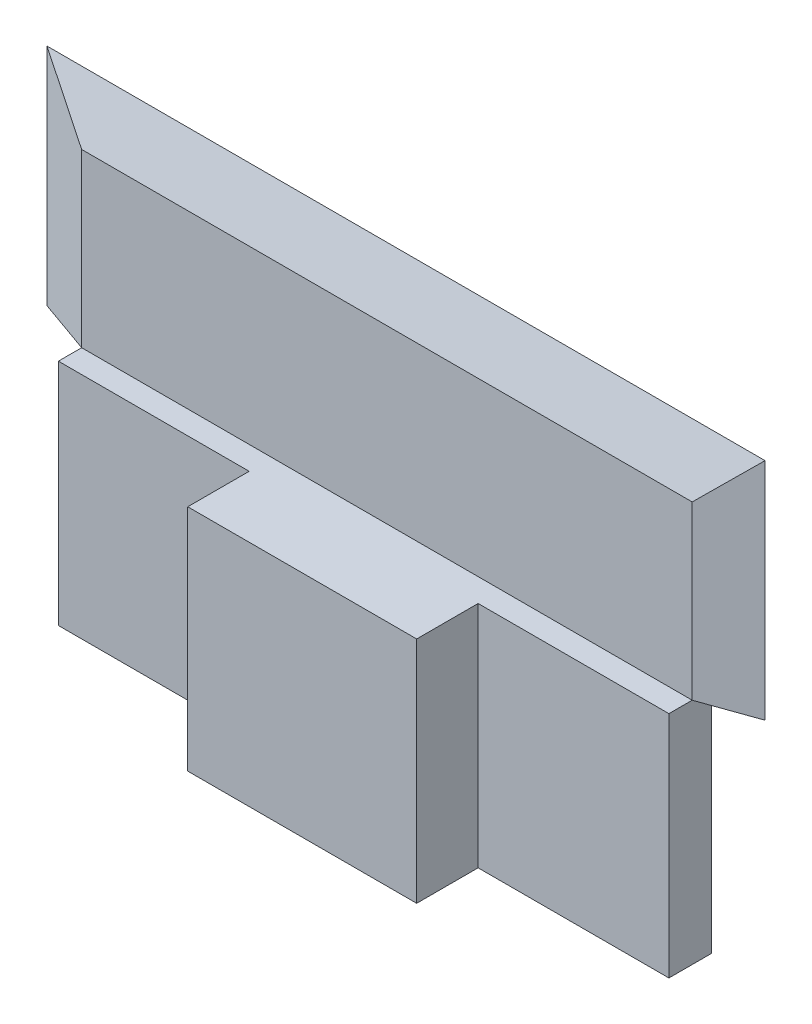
ISO-10303-21;
HEADER;
FILE_DESCRIPTION(('STEP AP214'),'2;1');
FILE_NAME('part.step','',(''),(''),'','','');
FILE_SCHEMA(('AUTOMOTIVE_DESIGN { 1 0 10303 214 1 1 1 1 }'));
ENDSEC;
DATA;
#1=APPLICATION_CONTEXT('core data for automotive mechanical design processes');
#2=APPLICATION_PROTOCOL_DEFINITION('international standard','automotive_design',2000,#1);
#3=PRODUCT_CONTEXT('',#1,'mechanical');
#4=PRODUCT('Part','Part','',(#3));
#5=PRODUCT_RELATED_PRODUCT_CATEGORY('part','',(#4));
#6=PRODUCT_DEFINITION_FORMATION('','',#4);
#7=PRODUCT_DEFINITION_CONTEXT('part definition',#1,'design');
#8=PRODUCT_DEFINITION('design','',#6,#7);
#9=PRODUCT_DEFINITION_SHAPE('','',#8);
#10=(LENGTH_UNIT() NAMED_UNIT(*) SI_UNIT(.MILLI.,.METRE.));
#11=(NAMED_UNIT(*) PLANE_ANGLE_UNIT() SI_UNIT($,.RADIAN.));
#12=(NAMED_UNIT(*) SI_UNIT($,.STERADIAN.) SOLID_ANGLE_UNIT());
#13=UNCERTAINTY_MEASURE_WITH_UNIT(LENGTH_MEASURE(1.E-05),#10,'distance_accuracy_value','');
#14=(GEOMETRIC_REPRESENTATION_CONTEXT(3) GLOBAL_UNCERTAINTY_ASSIGNED_CONTEXT((#13)) GLOBAL_UNIT_ASSIGNED_CONTEXT((#10,
#11,#12)) REPRESENTATION_CONTEXT('',''));
#15=CARTESIAN_POINT('',(0.,0.,0.));
#16=DIRECTION('',(0.,0.,1.));
#17=DIRECTION('',(1.,0.,0.));
#18=AXIS2_PLACEMENT_3D('',#15,#16,#17);
#19=CARTESIAN_POINT('',(0.,60.96,11.2776));
#20=DIRECTION('',(0.,-1.,0.));
#21=DIRECTION('',(0.,0.,-1.));
#22=AXIS2_PLACEMENT_3D('',#19,#20,#21);
#23=PLANE('',#22);
#24=DIRECTION('',(1.,0.,0.));
#25=VECTOR('',#24,1.);
#26=CARTESIAN_POINT('',(0.,60.96,5.08));
#27=LINE('',#26,#25);
#28=CARTESIAN_POINT('',(-81.28,60.96,5.08));
#29=VERTEX_POINT('',#28);
#30=CARTESIAN_POINT('',(81.28,60.96,5.08));
#31=VERTEX_POINT('',#30);
#32=EDGE_CURVE('E148',#29,#31,#27,.T.);
#33=ORIENTED_EDGE('',*,*,#32,.F.);
#34=DIRECTION('',(0.,0.,-1.));
#35=VECTOR('',#34,1.);
#36=CARTESIAN_POINT('',(-81.28,60.96,11.2776));
#37=LINE('',#36,#35);
#38=CARTESIAN_POINT('',(-81.28,60.96,11.2776));
#39=VERTEX_POINT('',#38);
#40=EDGE_CURVE('E152',#39,#29,#37,.T.);
#41=ORIENTED_EDGE('',*,*,#40,.F.);
#42=DIRECTION('',(1.,0.,0.));
#43=VECTOR('',#42,1.);
#44=CARTESIAN_POINT('',(0.,60.96,11.2776));
#45=LINE('',#44,#43);
#46=CARTESIAN_POINT('',(-30.48,60.96,11.2776));
#47=VERTEX_POINT('',#46);
#48=EDGE_CURVE('E337',#39,#47,#45,.T.);
#49=ORIENTED_EDGE('',*,*,#48,.T.);
#50=DIRECTION('',(0.,0.,-1.));
#51=VECTOR('',#50,1.);
#52=CARTESIAN_POINT('',(-30.48,60.96,27.6352));
#53=LINE('',#52,#51);
#54=CARTESIAN_POINT('',(-30.48,60.96,27.6352));
#55=VERTEX_POINT('',#54);
#56=EDGE_CURVE('E338',#55,#47,#53,.T.);
#57=ORIENTED_EDGE('',*,*,#56,.F.);
#58=DIRECTION('',(-1.,0.,0.));
#59=VECTOR('',#58,1.);
#60=CARTESIAN_POINT('',(0.,60.96,27.6352));
#61=LINE('',#60,#59);
#62=CARTESIAN_POINT('',(30.48,60.96,27.6352));
#63=VERTEX_POINT('',#62);
#64=EDGE_CURVE('E359',#63,#55,#61,.T.);
#65=ORIENTED_EDGE('',*,*,#64,.F.);
#66=DIRECTION('',(0.,0.,-1.));
#67=VECTOR('',#66,1.);
#68=CARTESIAN_POINT('',(30.48,60.96,27.6352));
#69=LINE('',#68,#67);
#70=CARTESIAN_POINT('',(30.48,60.96,11.2776));
#71=VERTEX_POINT('',#70);
#72=EDGE_CURVE('E514',#63,#71,#69,.T.);
#73=ORIENTED_EDGE('',*,*,#72,.T.);
#74=DIRECTION('',(-1.,0.,0.));
#75=VECTOR('',#74,1.);
#76=CARTESIAN_POINT('',(0.,60.96,11.2776));
#77=LINE('',#76,#75);
#78=CARTESIAN_POINT('',(81.28,60.96,11.2776));
#79=VERTEX_POINT('',#78);
#80=EDGE_CURVE('E518',#79,#71,#77,.T.);
#81=ORIENTED_EDGE('',*,*,#80,.F.);
#82=DIRECTION('',(0.,0.,-1.));
#83=VECTOR('',#82,1.);
#84=CARTESIAN_POINT('',(81.28,60.96,11.2776));
#85=LINE('',#84,#83);
#86=EDGE_CURVE('E60',#79,#31,#85,.T.);
#87=ORIENTED_EDGE('',*,*,#86,.T.);
#88=EDGE_LOOP('',(#33,#41,#49,#57,#65,#73,#81,#87));
#89=FACE_BOUND('',#88,.T.);
#90=ADVANCED_FACE('F49',(#89),#23,.F.);
#91=CARTESIAN_POINT('',(0.,0.,11.2776));
#92=DIRECTION('',(0.,0.,-1.));
#93=DIRECTION('',(-1.,0.,0.));
#94=AXIS2_PLACEMENT_3D('',#91,#92,#93);
#95=PLANE('',#94);
#96=DIRECTION('',(0.,1.,0.));
#97=VECTOR('',#96,1.);
#98=CARTESIAN_POINT('',(30.48,60.96,11.2776));
#99=LINE('',#98,#97);
#100=CARTESIAN_POINT('',(30.48,0.,11.2776));
#101=VERTEX_POINT('',#100);
#102=EDGE_CURVE('E76',#101,#71,#99,.T.);
#103=ORIENTED_EDGE('',*,*,#102,.F.);
#104=DIRECTION('',(1.,0.,0.));
#105=VECTOR('',#104,1.);
#106=CARTESIAN_POINT('',(0.,0.,11.2776));
#107=LINE('',#106,#105);
#108=CARTESIAN_POINT('',(81.28,0.,11.2776));
#109=VERTEX_POINT('',#108);
#110=EDGE_CURVE('E424',#101,#109,#107,.T.);
#111=ORIENTED_EDGE('',*,*,#110,.T.);
#112=DIRECTION('',(0.,1.,0.));
#113=VECTOR('',#112,1.);
#114=CARTESIAN_POINT('',(81.28,0.,11.2776));
#115=LINE('',#114,#113);
#116=EDGE_CURVE('E426',#109,#79,#115,.T.);
#117=ORIENTED_EDGE('',*,*,#116,.T.);
#118=ORIENTED_EDGE('',*,*,#80,.T.);
#119=EDGE_LOOP('',(#103,#111,#117,#118));
#120=FACE_BOUND('',#119,.T.);
#121=ADVANCED_FACE('F401',(#120),#95,.F.);
#122=CARTESIAN_POINT('',(0.,0.,11.2776));
#123=DIRECTION('',(0.,1.,0.));
#124=DIRECTION('',(0.,0.,1.));
#125=AXIS2_PLACEMENT_3D('',#122,#123,#124);
#126=PLANE('',#125);
#127=DIRECTION('',(1.,0.,0.));
#128=VECTOR('',#127,1.);
#129=CARTESIAN_POINT('',(0.,0.,0.));
#130=LINE('',#129,#128);
#131=CARTESIAN_POINT('',(-81.28,0.,0.));
#132=VERTEX_POINT('',#131);
#133=CARTESIAN_POINT('',(81.28,0.,0.));
#134=VERTEX_POINT('',#133);
#135=EDGE_CURVE('E354',#132,#134,#130,.T.);
#136=ORIENTED_EDGE('',*,*,#135,.T.);
#137=DIRECTION('',(0.,0.,-1.));
#138=VECTOR('',#137,1.);
#139=CARTESIAN_POINT('',(81.28,0.,11.2776));
#140=LINE('',#139,#138);
#141=EDGE_CURVE('E12',#109,#134,#140,.T.);
#142=ORIENTED_EDGE('',*,*,#141,.F.);
#143=ORIENTED_EDGE('',*,*,#110,.F.);
#144=DIRECTION('',(0.,0.,-1.));
#145=VECTOR('',#144,1.);
#146=CARTESIAN_POINT('',(30.48,0.,27.6352));
#147=LINE('',#146,#145);
#148=CARTESIAN_POINT('',(30.48,0.,27.6352));
#149=VERTEX_POINT('',#148);
#150=EDGE_CURVE('E428',#149,#101,#147,.T.);
#151=ORIENTED_EDGE('',*,*,#150,.F.);
#152=DIRECTION('',(1.,0.,0.));
#153=VECTOR('',#152,1.);
#154=CARTESIAN_POINT('',(0.,0.,27.6352));
#155=LINE('',#154,#153);
#156=CARTESIAN_POINT('',(-30.48,0.,27.6352));
#157=VERTEX_POINT('',#156);
#158=EDGE_CURVE('E316',#157,#149,#155,.T.);
#159=ORIENTED_EDGE('',*,*,#158,.F.);
#160=DIRECTION('',(0.,0.,-1.));
#161=VECTOR('',#160,1.);
#162=CARTESIAN_POINT('',(-30.48,0.,27.6352));
#163=LINE('',#162,#161);
#164=CARTESIAN_POINT('',(-30.48,0.,11.2776));
#165=VERTEX_POINT('',#164);
#166=EDGE_CURVE('E341',#157,#165,#163,.T.);
#167=ORIENTED_EDGE('',*,*,#166,.T.);
#168=DIRECTION('',(-1.,0.,0.));
#169=VECTOR('',#168,1.);
#170=CARTESIAN_POINT('',(0.,0.,11.2776));
#171=LINE('',#170,#169);
#172=CARTESIAN_POINT('',(-81.28,0.,11.2776));
#173=VERTEX_POINT('',#172);
#174=EDGE_CURVE('E349',#165,#173,#171,.T.);
#175=ORIENTED_EDGE('',*,*,#174,.T.);
#176=DIRECTION('',(0.,0.,-1.));
#177=VECTOR('',#176,1.);
#178=CARTESIAN_POINT('',(-81.28,0.,11.2776));
#179=LINE('',#178,#177);
#180=EDGE_CURVE('E175',#173,#132,#179,.T.);
#181=ORIENTED_EDGE('',*,*,#180,.T.);
#182=EDGE_LOOP('',(#136,#142,#143,#151,#159,#167,#175,#181));
#183=FACE_BOUND('',#182,.T.);
#184=ADVANCED_FACE('F51',(#183),#126,.F.);
#185=CARTESIAN_POINT('',(81.28,0.,11.2776));
#186=DIRECTION('',(-1.,0.,0.));
#187=DIRECTION('',(0.,0.,1.));
#188=AXIS2_PLACEMENT_3D('',#185,#186,#187);
#189=PLANE('',#188);
#190=DIRECTION('',(0.,1.,0.));
#191=VECTOR('',#190,1.);
#192=CARTESIAN_POINT('',(81.28,0.,0.));
#193=LINE('',#192,#191);
#194=CARTESIAN_POINT('',(81.28,60.96,0.));
#195=VERTEX_POINT('',#194);
#196=EDGE_CURVE('E420',#134,#195,#193,.T.);
#197=ORIENTED_EDGE('',*,*,#196,.T.);
#198=EDGE_CURVE('E421',#31,#195,#85,.T.);
#199=ORIENTED_EDGE('',*,*,#198,.F.);
#200=ORIENTED_EDGE('',*,*,#86,.F.);
#201=ORIENTED_EDGE('',*,*,#116,.F.);
#202=ORIENTED_EDGE('',*,*,#141,.T.);
#203=EDGE_LOOP('',(#197,#199,#200,#201,#202));
#204=FACE_BOUND('',#203,.T.);
#205=ADVANCED_FACE('F409',(#204),#189,.F.);
#206=CARTESIAN_POINT('',(0.,0.,0.));
#207=DIRECTION('',(0.,0.,-1.));
#208=DIRECTION('',(-1.,0.,0.));
#209=AXIS2_PLACEMENT_3D('',#206,#207,#208);
#210=PLANE('',#209);
#211=ORIENTED_EDGE('',*,*,#135,.F.);
#212=DIRECTION('',(0.,1.,0.));
#213=VECTOR('',#212,1.);
#214=CARTESIAN_POINT('',(-81.28,0.,0.));
#215=LINE('',#214,#213);
#216=CARTESIAN_POINT('',(-81.2800125,60.96,0.));
#217=VERTEX_POINT('',#216);
#218=EDGE_CURVE('E336',#132,#217,#215,.T.);
#219=ORIENTED_EDGE('',*,*,#218,.T.);
#220=DIRECTION('',(1.,0.,0.));
#221=VECTOR('',#220,1.);
#222=CARTESIAN_POINT('',(0.,60.96,0.));
#223=LINE('',#222,#221);
#224=CARTESIAN_POINT('',(-95.6056,60.96,0.));
#225=VERTEX_POINT('',#224);
#226=EDGE_CURVE('E170',#225,#217,#223,.T.);
#227=ORIENTED_EDGE('',*,*,#226,.F.);
#228=DIRECTION('',(0.,-1.,0.));
#229=VECTOR('',#228,1.);
#230=CARTESIAN_POINT('',(-95.6056,60.96,0.));
#231=LINE('',#230,#229);
#232=CARTESIAN_POINT('',(-95.6056,120.8278,0.));
#233=VERTEX_POINT('',#232);
#234=EDGE_CURVE('E184',#233,#225,#231,.T.);
#235=ORIENTED_EDGE('',*,*,#234,.F.);
#236=DIRECTION('',(-1.,0.,0.));
#237=VECTOR('',#236,1.);
#238=CARTESIAN_POINT('',(0.,120.8278,0.));
#239=LINE('',#238,#237);
#240=CARTESIAN_POINT('',(0.,120.8278,0.));
#241=VERTEX_POINT('',#240);
#242=EDGE_CURVE('E265',#241,#233,#239,.T.);
#243=ORIENTED_EDGE('',*,*,#242,.F.);
#244=DIRECTION('',(1.,0.,0.));
#245=VECTOR('',#244,1.);
#246=CARTESIAN_POINT('',(0.,120.8278,0.));
#247=LINE('',#246,#245);
#248=CARTESIAN_POINT('',(95.6056,120.8278,0.));
#249=VERTEX_POINT('',#248);
#250=EDGE_CURVE('E313',#241,#249,#247,.T.);
#251=ORIENTED_EDGE('',*,*,#250,.T.);
#252=DIRECTION('',(0.,-1.,0.));
#253=VECTOR('',#252,1.);
#254=CARTESIAN_POINT('',(95.6056,60.96,0.));
#255=LINE('',#254,#253);
#256=CARTESIAN_POINT('',(95.6056,60.96,0.));
#257=VERTEX_POINT('',#256);
#258=EDGE_CURVE('E309',#249,#257,#255,.T.);
#259=ORIENTED_EDGE('',*,*,#258,.T.);
#260=DIRECTION('',(-1.,0.,0.));
#261=VECTOR('',#260,1.);
#262=CARTESIAN_POINT('',(0.,60.96,0.));
#263=LINE('',#262,#261);
#264=EDGE_CURVE('E312',#257,#195,#263,.T.);
#265=ORIENTED_EDGE('',*,*,#264,.T.);
#266=ORIENTED_EDGE('',*,*,#196,.F.);
#267=EDGE_LOOP('',(#211,#219,#227,#235,#243,#251,#259,#265,#266));
#268=FACE_BOUND('',#267,.T.);
#269=ADVANCED_FACE('F407',(#268),#210,.T.);
#270=CARTESIAN_POINT('',(30.48,60.96,27.6352));
#271=DIRECTION('',(-1.,0.,0.));
#272=DIRECTION('',(0.,-1.,0.));
#273=AXIS2_PLACEMENT_3D('',#270,#271,#272);
#274=PLANE('',#273);
#275=ORIENTED_EDGE('',*,*,#102,.T.);
#276=ORIENTED_EDGE('',*,*,#72,.F.);
#277=DIRECTION('',(0.,1.,0.));
#278=VECTOR('',#277,1.);
#279=CARTESIAN_POINT('',(30.48,60.96,27.6352));
#280=LINE('',#279,#278);
#281=EDGE_CURVE('E511',#149,#63,#280,.T.);
#282=ORIENTED_EDGE('',*,*,#281,.F.);
#283=ORIENTED_EDGE('',*,*,#150,.T.);
#284=EDGE_LOOP('',(#275,#276,#282,#283));
#285=FACE_BOUND('',#284,.T.);
#286=ADVANCED_FACE('F416',(#285),#274,.F.);
#287=CARTESIAN_POINT('',(0.,0.,27.6352));
#288=DIRECTION('',(0.,0.,1.));
#289=DIRECTION('',(1.,0.,0.));
#290=AXIS2_PLACEMENT_3D('',#287,#288,#289);
#291=PLANE('',#290);
#292=ORIENTED_EDGE('',*,*,#64,.T.);
#293=DIRECTION('',(0.,1.,0.));
#294=VECTOR('',#293,1.);
#295=CARTESIAN_POINT('',(-30.48,60.96,27.6352));
#296=LINE('',#295,#294);
#297=EDGE_CURVE('E345',#157,#55,#296,.T.);
#298=ORIENTED_EDGE('',*,*,#297,.F.);
#299=ORIENTED_EDGE('',*,*,#158,.T.);
#300=ORIENTED_EDGE('',*,*,#281,.T.);
#301=EDGE_LOOP('',(#292,#298,#299,#300));
#302=FACE_BOUND('',#301,.T.);
#303=ADVANCED_FACE('F525',(#302),#291,.T.);
#304=CARTESIAN_POINT('',(0.,60.96,0.));
#305=DIRECTION('',(0.,1.,0.));
#306=DIRECTION('',(-1.,0.,0.));
#307=AXIS2_PLACEMENT_3D('',#304,#305,#306);
#308=PLANE('',#307);
#309=DIRECTION('',(0.942495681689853,0.,-0.334218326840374));
#310=VECTOR('',#309,1.);
#311=CARTESIAN_POINT('',(81.28,60.96,5.08));
#312=LINE('',#311,#310);
#313=EDGE_CURVE('E159',#31,#257,#312,.T.);
#314=ORIENTED_EDGE('',*,*,#313,.F.);
#315=ORIENTED_EDGE('',*,*,#198,.T.);
#316=ORIENTED_EDGE('',*,*,#264,.F.);
#317=EDGE_LOOP('',(#314,#315,#316));
#318=FACE_BOUND('',#317,.T.);
#319=ADVANCED_FACE('F241',(#318),#308,.F.);
#320=CARTESIAN_POINT('',(0.,0.,5.08));
#321=DIRECTION('',(0.,0.,-1.));
#322=DIRECTION('',(-1.,0.,0.));
#323=AXIS2_PLACEMENT_3D('',#320,#321,#322);
#324=PLANE('',#323);
#325=DIRECTION('',(-1.,0.,0.));
#326=VECTOR('',#325,1.);
#327=CARTESIAN_POINT('',(0.,106.68,5.08));
#328=LINE('',#327,#326);
#329=CARTESIAN_POINT('',(81.28,106.68,5.08));
#330=VERTEX_POINT('',#329);
#331=CARTESIAN_POINT('',(0.,106.68,5.08));
#332=VERTEX_POINT('',#331);
#333=EDGE_CURVE('E201',#330,#332,#328,.T.);
#334=ORIENTED_EDGE('',*,*,#333,.T.);
#335=DIRECTION('',(1.,0.,0.));
#336=VECTOR('',#335,1.);
#337=CARTESIAN_POINT('',(0.,106.68,5.08));
#338=LINE('',#337,#336);
#339=CARTESIAN_POINT('',(-81.28,106.68,5.08));
#340=VERTEX_POINT('',#339);
#341=EDGE_CURVE('E191',#340,#332,#338,.T.);
#342=ORIENTED_EDGE('',*,*,#341,.F.);
#343=DIRECTION('',(0.,1.,0.));
#344=VECTOR('',#343,1.);
#345=CARTESIAN_POINT('',(-81.28,60.96,5.08));
#346=LINE('',#345,#344);
#347=EDGE_CURVE('E180',#29,#340,#346,.T.);
#348=ORIENTED_EDGE('',*,*,#347,.F.);
#349=ORIENTED_EDGE('',*,*,#32,.T.);
#350=DIRECTION('',(0.,1.,0.));
#351=VECTOR('',#350,1.);
#352=CARTESIAN_POINT('',(81.28,60.96,5.08));
#353=LINE('',#352,#351);
#354=EDGE_CURVE('E160',#31,#330,#353,.T.);
#355=ORIENTED_EDGE('',*,*,#354,.T.);
#356=EDGE_LOOP('',(#334,#342,#348,#349,#355));
#357=FACE_BOUND('',#356,.T.);
#358=ADVANCED_FACE('F190',(#357),#324,.F.);
#359=CARTESIAN_POINT('',(10.6793262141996,0.,30.1156999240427));
#360=DIRECTION('',(-0.334218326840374,0.,-0.942495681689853));
#361=DIRECTION('',(-0.942495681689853,0.,0.334218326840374));
#362=AXIS2_PLACEMENT_3D('',#359,#360,#361);
#363=PLANE('',#362);
#364=ORIENTED_EDGE('',*,*,#313,.T.);
#365=ORIENTED_EDGE('',*,*,#258,.F.);
#366=DIRECTION('',(0.689888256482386,0.681325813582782,-0.244641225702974));
#367=VECTOR('',#366,1.);
#368=CARTESIAN_POINT('',(81.28,106.68,5.08));
#369=LINE('',#368,#367);
#370=EDGE_CURVE('E215',#330,#249,#369,.T.);
#371=ORIENTED_EDGE('',*,*,#370,.F.);
#372=ORIENTED_EDGE('',*,*,#354,.F.);
#373=EDGE_LOOP('',(#364,#365,#371,#372));
#374=FACE_BOUND('',#373,.T.);
#375=ADVANCED_FACE('F238',(#374),#363,.F.);
#376=CARTESIAN_POINT('',(0.,13.7990743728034,38.4304221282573));
#377=DIRECTION('',(0.,-0.337941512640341,-0.941167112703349));
#378=DIRECTION('',(0.,0.941167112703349,-0.337941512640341));
#379=AXIS2_PLACEMENT_3D('',#376,#377,#378);
#380=PLANE('',#379);
#381=ORIENTED_EDGE('',*,*,#370,.T.);
#382=ORIENTED_EDGE('',*,*,#250,.F.);
#383=ORIENTED_EDGE('',*,*,#242,.T.);
#384=DIRECTION('',(-0.689888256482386,0.681325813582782,-0.244641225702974));
#385=VECTOR('',#384,1.);
#386=CARTESIAN_POINT('',(-81.28,106.68,5.08));
#387=LINE('',#386,#385);
#388=EDGE_CURVE('E186',#340,#233,#387,.T.);
#389=ORIENTED_EDGE('',*,*,#388,.F.);
#390=ORIENTED_EDGE('',*,*,#341,.T.);
#391=ORIENTED_EDGE('',*,*,#333,.F.);
#392=EDGE_LOOP('',(#381,#382,#383,#389,#390,#391));
#393=FACE_BOUND('',#392,.T.);
#394=ADVANCED_FACE('F228',(#393),#380,.F.);
#395=CARTESIAN_POINT('',(-81.28,0.,11.2776));
#396=DIRECTION('',(-1.,0.,0.));
#397=DIRECTION('',(0.,0.,1.));
#398=AXIS2_PLACEMENT_3D('',#395,#396,#397);
#399=PLANE('',#398);
#400=ORIENTED_EDGE('',*,*,#218,.F.);
#401=ORIENTED_EDGE('',*,*,#180,.F.);
#402=DIRECTION('',(0.,1.,0.));
#403=VECTOR('',#402,1.);
#404=CARTESIAN_POINT('',(-81.28,0.,11.2776));
#405=LINE('',#404,#403);
#406=EDGE_CURVE('E200',#173,#39,#405,.T.);
#407=ORIENTED_EDGE('',*,*,#406,.T.);
#408=ORIENTED_EDGE('',*,*,#40,.T.);
#409=EDGE_CURVE('E164',#29,#217,#37,.T.);
#410=ORIENTED_EDGE('',*,*,#409,.T.);
#411=EDGE_LOOP('',(#400,#401,#407,#408,#410));
#412=FACE_BOUND('',#411,.T.);
#413=ADVANCED_FACE('F197',(#412),#399,.T.);
#414=CARTESIAN_POINT('',(0.,0.,11.2776));
#415=DIRECTION('',(0.,0.,-1.));
#416=DIRECTION('',(1.,0.,0.));
#417=AXIS2_PLACEMENT_3D('',#414,#415,#416);
#418=PLANE('',#417);
#419=ORIENTED_EDGE('',*,*,#174,.F.);
#420=DIRECTION('',(0.,1.,0.));
#421=VECTOR('',#420,1.);
#422=CARTESIAN_POINT('',(-30.48,60.96,11.2776));
#423=LINE('',#422,#421);
#424=EDGE_CURVE('E68',#165,#47,#423,.T.);
#425=ORIENTED_EDGE('',*,*,#424,.T.);
#426=ORIENTED_EDGE('',*,*,#48,.F.);
#427=ORIENTED_EDGE('',*,*,#406,.F.);
#428=EDGE_LOOP('',(#419,#425,#426,#427));
#429=FACE_BOUND('',#428,.T.);
#430=ADVANCED_FACE('F356',(#429),#418,.F.);
#431=CARTESIAN_POINT('',(-30.48,60.96,27.6352));
#432=DIRECTION('',(-1.,0.,0.));
#433=DIRECTION('',(0.,-1.,0.));
#434=AXIS2_PLACEMENT_3D('',#431,#432,#433);
#435=PLANE('',#434);
#436=ORIENTED_EDGE('',*,*,#424,.F.);
#437=ORIENTED_EDGE('',*,*,#166,.F.);
#438=ORIENTED_EDGE('',*,*,#297,.T.);
#439=ORIENTED_EDGE('',*,*,#56,.T.);
#440=EDGE_LOOP('',(#436,#437,#438,#439));
#441=FACE_BOUND('',#440,.T.);
#442=ADVANCED_FACE('F361',(#441),#435,.T.);
#443=CARTESIAN_POINT('',(-10.6793262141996,0.,30.1156999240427));
#444=DIRECTION('',(0.334218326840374,0.,-0.942495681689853));
#445=DIRECTION('',(0.942495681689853,0.,0.334218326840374));
#446=AXIS2_PLACEMENT_3D('',#443,#444,#445);
#447=PLANE('',#446);
#448=DIRECTION('',(-0.942495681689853,0.,-0.334218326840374));
#449=VECTOR('',#448,1.);
#450=CARTESIAN_POINT('',(-81.28,60.96,5.08));
#451=LINE('',#450,#449);
#452=EDGE_CURVE('E167',#29,#225,#451,.T.);
#453=ORIENTED_EDGE('',*,*,#452,.F.);
#454=ORIENTED_EDGE('',*,*,#347,.T.);
#455=ORIENTED_EDGE('',*,*,#388,.T.);
#456=ORIENTED_EDGE('',*,*,#234,.T.);
#457=EDGE_LOOP('',(#453,#454,#455,#456));
#458=FACE_BOUND('',#457,.T.);
#459=ADVANCED_FACE('F179',(#458),#447,.F.);
#460=CARTESIAN_POINT('',(0.,60.96,0.));
#461=DIRECTION('',(0.,1.,0.));
#462=DIRECTION('',(1.,0.,0.));
#463=AXIS2_PLACEMENT_3D('',#460,#461,#462);
#464=PLANE('',#463);
#465=ORIENTED_EDGE('',*,*,#409,.F.);
#466=ORIENTED_EDGE('',*,*,#452,.T.);
#467=ORIENTED_EDGE('',*,*,#226,.T.);
#468=EDGE_LOOP('',(#465,#466,#467));
#469=FACE_BOUND('',#468,.T.);
#470=ADVANCED_FACE('F166',(#469),#464,.F.);
#471=CLOSED_SHELL('',(#90,#121,#184,#205,#269,#286,#303,#319,#358,#375,#394,#413,#430,#442,#459,#470));
#472=MANIFOLD_SOLID_BREP('B2',#471);
#473=ADVANCED_BREP_SHAPE_REPRESENTATION('',(#18,#472),#14);
#474=SHAPE_DEFINITION_REPRESENTATION(#9,#473);
ENDSEC;
END-ISO-10303-21;
